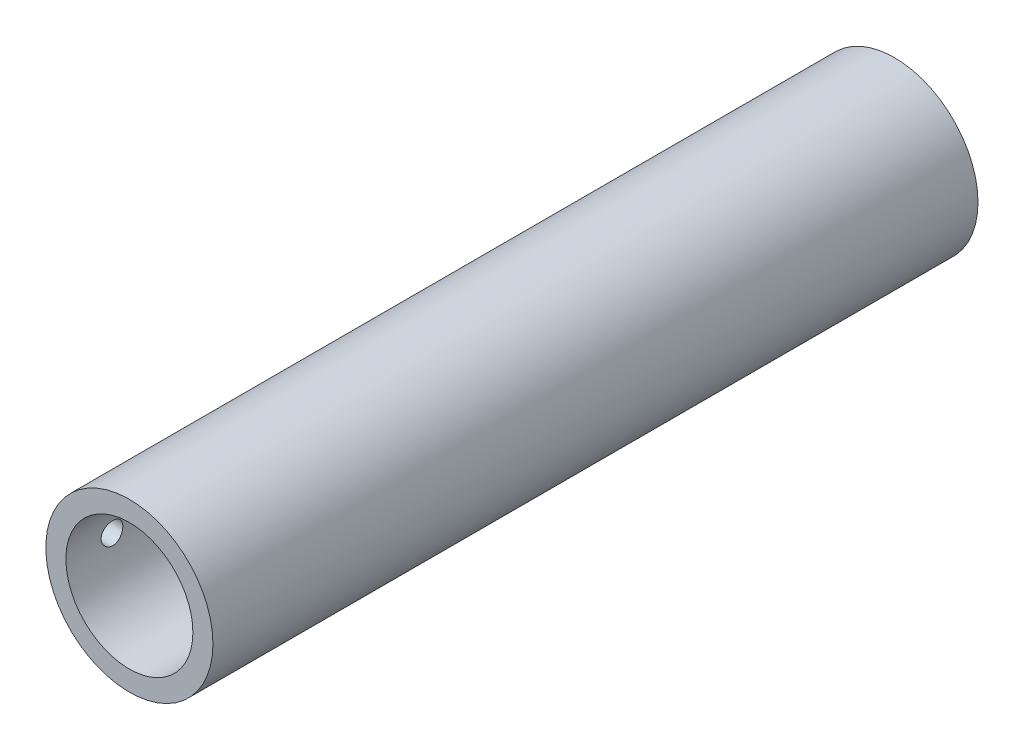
ISO-10303-21;
HEADER;
FILE_DESCRIPTION(('STEP AP214'),'2;1');
FILE_NAME('part.step','',(''),(''),'','','');
FILE_SCHEMA(('AUTOMOTIVE_DESIGN { 1 0 10303 214 1 1 1 1 }'));
ENDSEC;
DATA;
#1=APPLICATION_CONTEXT('core data for automotive mechanical design processes');
#2=APPLICATION_PROTOCOL_DEFINITION('international standard','automotive_design',2000,#1);
#3=PRODUCT_CONTEXT('',#1,'mechanical');
#4=PRODUCT('Part','Part','',(#3));
#5=PRODUCT_RELATED_PRODUCT_CATEGORY('part','',(#4));
#6=PRODUCT_DEFINITION_FORMATION('','',#4);
#7=PRODUCT_DEFINITION_CONTEXT('part definition',#1,'design');
#8=PRODUCT_DEFINITION('design','',#6,#7);
#9=PRODUCT_DEFINITION_SHAPE('','',#8);
#10=(LENGTH_UNIT() NAMED_UNIT(*) SI_UNIT(.MILLI.,.METRE.));
#11=(NAMED_UNIT(*) PLANE_ANGLE_UNIT() SI_UNIT($,.RADIAN.));
#12=(NAMED_UNIT(*) SI_UNIT($,.STERADIAN.) SOLID_ANGLE_UNIT());
#13=UNCERTAINTY_MEASURE_WITH_UNIT(LENGTH_MEASURE(1.E-05),#10,'distance_accuracy_value','');
#14=(GEOMETRIC_REPRESENTATION_CONTEXT(3) GLOBAL_UNCERTAINTY_ASSIGNED_CONTEXT((#13)) GLOBAL_UNIT_ASSIGNED_CONTEXT((#10,
#11,#12)) REPRESENTATION_CONTEXT('',''));
#15=CARTESIAN_POINT('',(0.,0.,0.));
#16=DIRECTION('',(0.,0.,1.));
#17=DIRECTION('',(1.,0.,0.));
#18=AXIS2_PLACEMENT_3D('',#15,#16,#17);
#19=CARTESIAN_POINT('',(0.,0.,116.3));
#20=DIRECTION('',(0.,0.,1.));
#21=DIRECTION('',(1.,0.,0.));
#22=AXIS2_PLACEMENT_3D('',#19,#20,#21);
#23=PLANE('',#22);
#24=CARTESIAN_POINT('',(0.,0.,116.3));
#25=DIRECTION('',(0.,0.,1.));
#26=DIRECTION('',(1.,0.,0.));
#27=AXIS2_PLACEMENT_3D('',#24,#25,#26);
#28=CIRCLE('',#27,12.7);
#29=CARTESIAN_POINT('',(12.7,0.,116.3));
#30=VERTEX_POINT('',#29);
#31=EDGE_CURVE('E10',#30,#30,#28,.T.);
#32=ORIENTED_EDGE('',*,*,#31,.T.);
#33=EDGE_LOOP('',(#32));
#34=FACE_BOUND('',#33,.T.);
#35=CARTESIAN_POINT('',(0.,0.,116.3));
#36=DIRECTION('',(0.,0.,1.));
#37=DIRECTION('',(1.,0.,0.));
#38=AXIS2_PLACEMENT_3D('',#35,#36,#37);
#39=CIRCLE('',#38,9.652);
#40=CARTESIAN_POINT('',(9.652,0.,116.3));
#41=VERTEX_POINT('',#40);
#42=EDGE_CURVE('E50',#41,#41,#39,.T.);
#43=ORIENTED_EDGE('',*,*,#42,.F.);
#44=EDGE_LOOP('',(#43));
#45=FACE_BOUND('',#44,.T.);
#46=ADVANCED_FACE('F32',(#34,#45),#23,.T.);
#47=CARTESIAN_POINT('',(0.,0.,0.));
#48=DIRECTION('',(0.,0.,1.));
#49=DIRECTION('',(1.,0.,0.));
#50=AXIS2_PLACEMENT_3D('',#47,#48,#49);
#51=PLANE('',#50);
#52=CARTESIAN_POINT('',(0.,0.,0.));
#53=DIRECTION('',(0.,0.,1.));
#54=DIRECTION('',(1.,0.,0.));
#55=AXIS2_PLACEMENT_3D('',#52,#53,#54);
#56=CIRCLE('',#55,12.7);
#57=CARTESIAN_POINT('',(12.7,0.,0.));
#58=VERTEX_POINT('',#57);
#59=EDGE_CURVE('E45',#58,#58,#56,.T.);
#60=ORIENTED_EDGE('',*,*,#59,.F.);
#61=EDGE_LOOP('',(#60));
#62=FACE_BOUND('',#61,.T.);
#63=CARTESIAN_POINT('',(0.,0.,0.));
#64=DIRECTION('',(0.,0.,1.));
#65=DIRECTION('',(1.,0.,0.));
#66=AXIS2_PLACEMENT_3D('',#63,#64,#65);
#67=CIRCLE('',#66,9.652);
#68=CARTESIAN_POINT('',(9.652,0.,0.));
#69=VERTEX_POINT('',#68);
#70=EDGE_CURVE('E53',#69,#69,#67,.T.);
#71=ORIENTED_EDGE('',*,*,#70,.T.);
#72=EDGE_LOOP('',(#71));
#73=FACE_BOUND('',#72,.T.);
#74=ADVANCED_FACE('F91',(#62,#73),#51,.F.);
#75=CARTESIAN_POINT('',(0.,0.,116.3));
#76=DIRECTION('',(0.,0.,-1.));
#77=DIRECTION('',(-1.,0.,0.));
#78=AXIS2_PLACEMENT_3D('',#75,#76,#77);
#79=CYLINDRICAL_SURFACE('',#78,12.7);
#80=CARTESIAN_POINT('',(-12.7,0.,19.65));
#81=CARTESIAN_POINT('',(-12.699998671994,-0.0922643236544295,19.6499960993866));
#82=CARTESIAN_POINT('',(-12.698983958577,-0.184585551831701,19.6422350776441));
#83=CARTESIAN_POINT('',(-12.6950336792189,-0.366656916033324,19.6113985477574));
#84=CARTESIAN_POINT('',(-12.6920961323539,-0.456404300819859,19.5883072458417));
#85=CARTESIAN_POINT('',(-12.6846309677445,-0.630665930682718,19.5275037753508));
#86=CARTESIAN_POINT('',(-12.6801044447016,-0.71518373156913,19.4898016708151));
#87=CARTESIAN_POINT('',(-12.6699641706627,-0.876677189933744,19.4008693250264));
#88=CARTESIAN_POINT('',(-12.6643505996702,-0.95365409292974,19.3496413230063));
#89=CARTESIAN_POINT('',(-12.6526253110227,-1.09835248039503,19.2347869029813));
#90=CARTESIAN_POINT('',(-12.6465111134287,-1.16602280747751,19.1710962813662));
#91=CARTESIAN_POINT('',(-12.6344935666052,-1.28974639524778,19.0332624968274));
#92=CARTESIAN_POINT('',(-12.628590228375,-1.34579905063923,18.9591187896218));
#93=CARTESIAN_POINT('',(-12.6176384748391,-1.44488838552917,18.8021488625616));
#94=CARTESIAN_POINT('',(-12.6125932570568,-1.48787683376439,18.7192919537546));
#95=CARTESIAN_POINT('',(-12.6039619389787,-1.5593094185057,18.5474581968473));
#96=CARTESIAN_POINT('',(-12.6003757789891,-1.58775415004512,18.4584815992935));
#97=CARTESIAN_POINT('',(-12.5950924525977,-1.62913573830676,18.2774665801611));
#98=CARTESIAN_POINT('',(-12.5933847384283,-1.64215921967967,18.1854482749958));
#99=CARTESIAN_POINT('',(-12.5920194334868,-1.65259672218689,18.0005175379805));
#100=CARTESIAN_POINT('',(-12.5923617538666,-1.65001141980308,17.9076051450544));
#101=CARTESIAN_POINT('',(-12.595048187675,-1.62937579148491,17.7241288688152));
#102=CARTESIAN_POINT('',(-12.5973799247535,-1.61142107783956,17.6335540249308));
#103=CARTESIAN_POINT('',(-12.6037631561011,-1.5607055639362,17.4567138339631));
#104=CARTESIAN_POINT('',(-12.6078146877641,-1.52794444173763,17.3704485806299));
#105=CARTESIAN_POINT('',(-12.6171949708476,-1.44844392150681,17.2043804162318));
#106=CARTESIAN_POINT('',(-12.6225274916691,-1.40166316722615,17.1245975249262));
#107=CARTESIAN_POINT('',(-12.6338660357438,-1.29548087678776,16.9739782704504));
#108=CARTESIAN_POINT('',(-12.6398720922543,-1.23607871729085,16.9031423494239));
#109=CARTESIAN_POINT('',(-12.6519359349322,-1.10581086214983,16.7718729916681));
#110=CARTESIAN_POINT('',(-12.6579937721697,-1.03486279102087,16.7115212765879));
#111=CARTESIAN_POINT('',(-12.6694366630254,-0.88380016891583,16.6035704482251));
#112=CARTESIAN_POINT('',(-12.6748217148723,-0.803685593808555,16.5559713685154));
#113=CARTESIAN_POINT('',(-12.6843160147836,-0.63649967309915,16.4748761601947));
#114=CARTESIAN_POINT('',(-12.6884247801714,-0.549425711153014,16.4413853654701));
#115=CARTESIAN_POINT('',(-12.6948992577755,-0.370824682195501,16.3895234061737));
#116=CARTESIAN_POINT('',(-12.697265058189,-0.279297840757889,16.371151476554));
#117=CARTESIAN_POINT('',(-12.6999755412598,-0.0950955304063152,16.3501551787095));
#118=CARTESIAN_POINT('',(-12.7003346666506,-0.00243309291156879,16.3474182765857));
#119=CARTESIAN_POINT('',(-12.6990303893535,0.182029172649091,16.357472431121));
#120=CARTESIAN_POINT('',(-12.6973670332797,0.273829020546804,16.3702631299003));
#121=CARTESIAN_POINT('',(-12.6922136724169,0.453626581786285,16.4109158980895));
#122=CARTESIAN_POINT('',(-12.6887301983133,0.541636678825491,16.4387240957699));
#123=CARTESIAN_POINT('',(-12.6803264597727,0.711744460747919,16.508566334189));
#124=CARTESIAN_POINT('',(-12.6754061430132,0.793841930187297,16.5506008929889));
#125=CARTESIAN_POINT('',(-12.6646409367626,0.950295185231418,16.6479734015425));
#126=CARTESIAN_POINT('',(-12.6587910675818,1.02460547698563,16.7033838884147));
#127=CARTESIAN_POINT('',(-12.6468361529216,1.1629116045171,16.8258330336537));
#128=CARTESIAN_POINT('',(-12.6407310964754,1.22690699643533,16.8928721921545));
#129=CARTESIAN_POINT('',(-12.6289090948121,1.34316787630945,17.0371723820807));
#130=CARTESIAN_POINT('',(-12.6231947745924,1.39535861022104,17.114493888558));
#131=CARTESIAN_POINT('',(-12.6128450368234,1.48601166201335,17.2768714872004));
#132=CARTESIAN_POINT('',(-12.608209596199,1.52447427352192,17.3619274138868));
#133=CARTESIAN_POINT('',(-12.6005605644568,1.58645918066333,17.537121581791));
#134=CARTESIAN_POINT('',(-12.5975424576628,1.61002310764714,17.6272448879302));
#135=CARTESIAN_POINT('',(-12.5934570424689,1.64167555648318,17.810211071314));
#136=CARTESIAN_POINT('',(-12.5923896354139,1.6497648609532,17.9030538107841));
#137=CARTESIAN_POINT('',(-12.5923295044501,1.65022329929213,18.0880794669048));
#138=CARTESIAN_POINT('',(-12.5933212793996,1.64270988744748,18.180262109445));
#139=CARTESIAN_POINT('',(-12.5972343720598,1.61242543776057,18.3620422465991));
#140=CARTESIAN_POINT('',(-12.6001556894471,1.58965440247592,18.4516397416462));
#141=CARTESIAN_POINT('',(-12.6075937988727,1.52953872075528,18.6256876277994));
#142=CARTESIAN_POINT('',(-12.6121099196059,1.49220020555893,18.7101401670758));
#143=CARTESIAN_POINT('',(-12.6222298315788,1.40402101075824,18.8716002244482));
#144=CARTESIAN_POINT('',(-12.6278336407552,1.35318010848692,18.9486076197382));
#145=CARTESIAN_POINT('',(-12.6395480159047,1.23900511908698,19.0935912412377));
#146=CARTESIAN_POINT('',(-12.6456619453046,1.17558357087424,19.1614983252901));
#147=CARTESIAN_POINT('',(-12.6576782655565,1.03823082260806,19.2857502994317));
#148=CARTESIAN_POINT('',(-12.6635806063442,0.964297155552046,19.3420924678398));
#149=CARTESIAN_POINT('',(-12.6745356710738,0.807668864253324,19.4418142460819));
#150=CARTESIAN_POINT('',(-12.6795848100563,0.724939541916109,19.4851397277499));
#151=CARTESIAN_POINT('',(-12.6882285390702,0.553358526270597,19.5572202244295));
#152=CARTESIAN_POINT('',(-12.6918246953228,0.464513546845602,19.5859909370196));
#153=CARTESIAN_POINT('',(-12.6962987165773,0.312682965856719,19.6213236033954));
#154=CARTESIAN_POINT('',(-12.6976798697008,0.250651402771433,19.6320616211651));
#155=CARTESIAN_POINT('',(-12.6995309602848,0.125755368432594,19.6464011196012));
#156=CARTESIAN_POINT('',(-12.7000009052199,0.0628909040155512,19.6500026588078));
#157=CARTESIAN_POINT('',(-12.7,0.,19.65));
#158=B_SPLINE_CURVE_WITH_KNOTS('',3,(#80,#81,#82,#83,#84,#85,#86,#87,#88,#89,#90,#91,#92,#93,
#94,#95,#96,#97,#98,#99,#100,#101,#102,#103,#104,#105,#106,#107,#108,#109,#110,#111,#112,#113,
#114,#115,#116,#117,#118,#119,#120,#121,#122,#123,#124,#125,#126,#127,#128,#129,#130,#131,#132,
#133,#134,#135,#136,#137,#138,#139,#140,#141,#142,#143,#144,#145,#146,#147,#148,#149,#150,#151,
#152,#153,#154,#155,#156,#157),.UNSPECIFIED.,.T.,.F.,(4,2,2,2,2,2,2,2,2,2,2,2,2,2,2,2,2,2,2,2,2,
2,2,2,2,2,2,2,2,2,2,2,2,2,2,2,2,2,4),(0.,0.276563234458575,0.553411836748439,0.830070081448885,
1.10668255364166,1.38475946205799,1.66285085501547,1.94195678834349,2.22105130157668,
2.49857052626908,2.77607772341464,3.05187100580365,3.327670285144,3.60429128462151,
3.88092594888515,4.15962857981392,4.43833194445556,4.71714058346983,4.99593511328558,
5.27272045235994,5.54949941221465,5.82529202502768,6.10109468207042,6.37842800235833,
6.65577325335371,6.93482849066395,7.21387775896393,7.49214379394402,7.77039575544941,
8.04656068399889,8.32272556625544,8.59877433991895,8.8748276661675,9.1528719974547,
9.43098168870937,9.71023234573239,9.98918118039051,10.1776988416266,10.3662149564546),.UNSPECIFIED.);
#159=CARTESIAN_POINT('',(-12.7,0.,19.65));
#160=VERTEX_POINT('',#159);
#161=EDGE_CURVE('E150',#160,#160,#158,.T.);
#162=ORIENTED_EDGE('',*,*,#161,.T.);
#163=EDGE_LOOP('',(#162));
#164=FACE_BOUND('',#163,.T.);
#165=CARTESIAN_POINT('',(-12.7,0.,31.45));
#166=CARTESIAN_POINT('',(-12.699998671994,-0.0922643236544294,31.4499960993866));
#167=CARTESIAN_POINT('',(-12.698983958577,-0.184585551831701,31.4422350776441));
#168=CARTESIAN_POINT('',(-12.6950336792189,-0.366656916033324,31.4113985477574));
#169=CARTESIAN_POINT('',(-12.6920961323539,-0.456404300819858,31.3883072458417));
#170=CARTESIAN_POINT('',(-12.6846309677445,-0.630665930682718,31.3275037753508));
#171=CARTESIAN_POINT('',(-12.6801044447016,-0.71518373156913,31.2898016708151));
#172=CARTESIAN_POINT('',(-12.6699641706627,-0.876677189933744,31.2008693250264));
#173=CARTESIAN_POINT('',(-12.6643505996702,-0.95365409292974,31.1496413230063));
#174=CARTESIAN_POINT('',(-12.6526253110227,-1.09835248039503,31.0347869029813));
#175=CARTESIAN_POINT('',(-12.6465111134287,-1.16602280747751,30.9710962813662));
#176=CARTESIAN_POINT('',(-12.6344935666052,-1.28974639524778,30.8332624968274));
#177=CARTESIAN_POINT('',(-12.628590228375,-1.34579905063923,30.7591187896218));
#178=CARTESIAN_POINT('',(-12.6176384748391,-1.44488838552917,30.6021488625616));
#179=CARTESIAN_POINT('',(-12.6125932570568,-1.48787683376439,30.5192919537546));
#180=CARTESIAN_POINT('',(-12.6039619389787,-1.5593094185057,30.3474581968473));
#181=CARTESIAN_POINT('',(-12.6003757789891,-1.58775415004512,30.2584815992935));
#182=CARTESIAN_POINT('',(-12.5950924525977,-1.62913573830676,30.0774665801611));
#183=CARTESIAN_POINT('',(-12.5933847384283,-1.64215921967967,29.9854482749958));
#184=CARTESIAN_POINT('',(-12.5920194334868,-1.65259672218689,29.8005175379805));
#185=CARTESIAN_POINT('',(-12.5923617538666,-1.65001141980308,29.7076051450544));
#186=CARTESIAN_POINT('',(-12.595048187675,-1.62937579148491,29.5241288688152));
#187=CARTESIAN_POINT('',(-12.5973799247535,-1.61142107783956,29.4335540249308));
#188=CARTESIAN_POINT('',(-12.6037631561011,-1.5607055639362,29.2567138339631));
#189=CARTESIAN_POINT('',(-12.6078146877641,-1.52794444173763,29.1704485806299));
#190=CARTESIAN_POINT('',(-12.6171949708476,-1.44844392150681,29.0043804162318));
#191=CARTESIAN_POINT('',(-12.6225274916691,-1.40166316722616,28.9245975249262));
#192=CARTESIAN_POINT('',(-12.6338660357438,-1.29548087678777,28.7739782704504));
#193=CARTESIAN_POINT('',(-12.6398720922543,-1.23607871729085,28.7031423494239));
#194=CARTESIAN_POINT('',(-12.6519359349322,-1.10581086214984,28.5718729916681));
#195=CARTESIAN_POINT('',(-12.6579937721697,-1.03486279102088,28.5115212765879));
#196=CARTESIAN_POINT('',(-12.6694366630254,-0.883800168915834,28.403570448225));
#197=CARTESIAN_POINT('',(-12.6748217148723,-0.803685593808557,28.3559713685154));
#198=CARTESIAN_POINT('',(-12.6843160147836,-0.63649967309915,28.2748761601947));
#199=CARTESIAN_POINT('',(-12.6884247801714,-0.549425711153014,28.2413853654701));
#200=CARTESIAN_POINT('',(-12.6948992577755,-0.370824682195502,28.1895234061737));
#201=CARTESIAN_POINT('',(-12.697265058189,-0.27929784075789,28.171151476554));
#202=CARTESIAN_POINT('',(-12.6999755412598,-0.0950955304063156,28.1501551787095));
#203=CARTESIAN_POINT('',(-12.7003346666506,-0.00243309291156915,28.1474182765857));
#204=CARTESIAN_POINT('',(-12.6990303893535,0.182029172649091,28.157472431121));
#205=CARTESIAN_POINT('',(-12.6973670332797,0.273829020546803,28.1702631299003));
#206=CARTESIAN_POINT('',(-12.6922136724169,0.453626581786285,28.2109158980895));
#207=CARTESIAN_POINT('',(-12.6887301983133,0.541636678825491,28.2387240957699));
#208=CARTESIAN_POINT('',(-12.6803264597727,0.711744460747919,28.308566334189));
#209=CARTESIAN_POINT('',(-12.6754061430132,0.793841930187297,28.3506008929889));
#210=CARTESIAN_POINT('',(-12.6646409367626,0.950295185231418,28.4479734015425));
#211=CARTESIAN_POINT('',(-12.6587910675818,1.02460547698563,28.5033838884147));
#212=CARTESIAN_POINT('',(-12.6468361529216,1.1629116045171,28.6258330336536));
#213=CARTESIAN_POINT('',(-12.6407310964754,1.22690699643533,28.6928721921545));
#214=CARTESIAN_POINT('',(-12.6289090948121,1.34316787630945,28.8371723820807));
#215=CARTESIAN_POINT('',(-12.6231947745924,1.39535861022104,28.9144938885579));
#216=CARTESIAN_POINT('',(-12.6128450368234,1.48601166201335,29.0768714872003));
#217=CARTESIAN_POINT('',(-12.608209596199,1.52447427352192,29.1619274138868));
#218=CARTESIAN_POINT('',(-12.6005605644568,1.58645918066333,29.337121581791));
#219=CARTESIAN_POINT('',(-12.5975424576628,1.61002310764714,29.4272448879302));
#220=CARTESIAN_POINT('',(-12.5934570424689,1.64167555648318,29.6102110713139));
#221=CARTESIAN_POINT('',(-12.5923896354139,1.6497648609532,29.7030538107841));
#222=CARTESIAN_POINT('',(-12.5923295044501,1.65022329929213,29.8880794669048));
#223=CARTESIAN_POINT('',(-12.5933212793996,1.64270988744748,29.980262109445));
#224=CARTESIAN_POINT('',(-12.5972343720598,1.61242543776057,30.1620422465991));
#225=CARTESIAN_POINT('',(-12.6001556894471,1.58965440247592,30.2516397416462));
#226=CARTESIAN_POINT('',(-12.6075937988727,1.52953872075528,30.4256876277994));
#227=CARTESIAN_POINT('',(-12.6121099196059,1.49220020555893,30.5101401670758));
#228=CARTESIAN_POINT('',(-12.6222298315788,1.40402101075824,30.6716002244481));
#229=CARTESIAN_POINT('',(-12.6278336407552,1.35318010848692,30.7486076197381));
#230=CARTESIAN_POINT('',(-12.6395480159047,1.23900511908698,30.8935912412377));
#231=CARTESIAN_POINT('',(-12.6456619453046,1.17558357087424,30.9614983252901));
#232=CARTESIAN_POINT('',(-12.6576782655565,1.03823082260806,31.0857502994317));
#233=CARTESIAN_POINT('',(-12.6635806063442,0.964297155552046,31.1420924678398));
#234=CARTESIAN_POINT('',(-12.6745356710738,0.807668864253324,31.2418142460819));
#235=CARTESIAN_POINT('',(-12.6795848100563,0.72493954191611,31.2851397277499));
#236=CARTESIAN_POINT('',(-12.6882285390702,0.553358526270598,31.3572202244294));
#237=CARTESIAN_POINT('',(-12.6918246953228,0.464513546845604,31.3859909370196));
#238=CARTESIAN_POINT('',(-12.6962987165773,0.312682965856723,31.4213236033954));
#239=CARTESIAN_POINT('',(-12.6976798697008,0.250651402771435,31.4320616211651));
#240=CARTESIAN_POINT('',(-12.6995309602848,0.125755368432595,31.4464011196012));
#241=CARTESIAN_POINT('',(-12.7000009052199,0.062890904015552,31.4500026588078));
#242=CARTESIAN_POINT('',(-12.7,0.,31.45));
#243=B_SPLINE_CURVE_WITH_KNOTS('',3,(#165,#166,#167,#168,#169,#170,#171,#172,#173,#174,#175,
#176,#177,#178,#179,#180,#181,#182,#183,#184,#185,#186,#187,#188,#189,#190,#191,#192,#193,#194,
#195,#196,#197,#198,#199,#200,#201,#202,#203,#204,#205,#206,#207,#208,#209,#210,#211,#212,#213,
#214,#215,#216,#217,#218,#219,#220,#221,#222,#223,#224,#225,#226,#227,#228,#229,#230,#231,#232,
#233,#234,#235,#236,#237,#238,#239,#240,#241,#242),.UNSPECIFIED.,.T.,.F.,(4,2,2,2,2,2,2,2,2,2,2,
2,2,2,2,2,2,2,2,2,2,2,2,2,2,2,2,2,2,2,2,2,2,2,2,2,2,2,4),(0.,0.276563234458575,
0.553411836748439,0.830070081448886,1.10668255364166,1.38475946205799,1.66285085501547,
1.94195678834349,2.22105130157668,2.49857052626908,2.77607772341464,3.05187100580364,
3.327670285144,3.6042912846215,3.88092594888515,4.15962857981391,4.43833194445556,
4.71714058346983,4.99593511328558,5.27272045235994,5.54949941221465,5.82529202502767,
6.10109468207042,6.37842800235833,6.65577325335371,6.93482849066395,7.21387775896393,
7.49214379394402,7.7703957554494,8.04656068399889,8.32272556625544,8.59877433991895,
8.8748276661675,9.1528719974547,9.43098168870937,9.71023234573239,9.9891811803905,
10.1776988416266,10.3662149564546),.UNSPECIFIED.);
#244=CARTESIAN_POINT('',(-12.7,0.,31.45));
#245=VERTEX_POINT('',#244);
#246=EDGE_CURVE('E62',#245,#245,#243,.T.);
#247=ORIENTED_EDGE('',*,*,#246,.T.);
#248=EDGE_LOOP('',(#247));
#249=FACE_BOUND('',#248,.T.);
#250=CARTESIAN_POINT('',(-12.7,0.,110.95));
#251=CARTESIAN_POINT('',(-12.699998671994,-0.0922643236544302,110.949996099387));
#252=CARTESIAN_POINT('',(-12.698983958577,-0.184585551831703,110.942235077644));
#253=CARTESIAN_POINT('',(-12.6950336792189,-0.366656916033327,110.911398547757));
#254=CARTESIAN_POINT('',(-12.6920961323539,-0.456404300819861,110.888307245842));
#255=CARTESIAN_POINT('',(-12.6846309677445,-0.630665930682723,110.827503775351));
#256=CARTESIAN_POINT('',(-12.6801044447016,-0.715183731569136,110.789801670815));
#257=CARTESIAN_POINT('',(-12.6699641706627,-0.876677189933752,110.700869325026));
#258=CARTESIAN_POINT('',(-12.6643505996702,-0.953654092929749,110.649641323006));
#259=CARTESIAN_POINT('',(-12.6526253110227,-1.09835248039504,110.534786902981));
#260=CARTESIAN_POINT('',(-12.6465111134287,-1.16602280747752,110.471096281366));
#261=CARTESIAN_POINT('',(-12.6344935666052,-1.28974639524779,110.333262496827));
#262=CARTESIAN_POINT('',(-12.628590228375,-1.34579905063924,110.259118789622));
#263=CARTESIAN_POINT('',(-12.6176384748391,-1.44488838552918,110.102148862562));
#264=CARTESIAN_POINT('',(-12.6125932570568,-1.4878768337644,110.019291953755));
#265=CARTESIAN_POINT('',(-12.6039619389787,-1.55930941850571,109.847458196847));
#266=CARTESIAN_POINT('',(-12.6003757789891,-1.58775415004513,109.758481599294));
#267=CARTESIAN_POINT('',(-12.5950924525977,-1.62913573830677,109.577466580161));
#268=CARTESIAN_POINT('',(-12.5933847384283,-1.64215921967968,109.485448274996));
#269=CARTESIAN_POINT('',(-12.5920194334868,-1.65259672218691,109.300517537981));
#270=CARTESIAN_POINT('',(-12.5923617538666,-1.6500114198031,109.207605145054));
#271=CARTESIAN_POINT('',(-12.5950481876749,-1.62937579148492,109.024128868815));
#272=CARTESIAN_POINT('',(-12.5973799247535,-1.61142107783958,108.933554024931));
#273=CARTESIAN_POINT('',(-12.6037631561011,-1.56070556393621,108.756713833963));
#274=CARTESIAN_POINT('',(-12.6078146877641,-1.52794444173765,108.67044858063));
#275=CARTESIAN_POINT('',(-12.6171949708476,-1.44844392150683,108.504380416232));
#276=CARTESIAN_POINT('',(-12.6225274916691,-1.40166316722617,108.424597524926));
#277=CARTESIAN_POINT('',(-12.6338660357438,-1.29548087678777,108.27397827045));
#278=CARTESIAN_POINT('',(-12.6398720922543,-1.23607871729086,108.203142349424));
#279=CARTESIAN_POINT('',(-12.6519359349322,-1.10581086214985,108.071872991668));
#280=CARTESIAN_POINT('',(-12.6579937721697,-1.03486279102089,108.011521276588));
#281=CARTESIAN_POINT('',(-12.6694366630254,-0.883800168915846,107.903570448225));
#282=CARTESIAN_POINT('',(-12.6748217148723,-0.803685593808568,107.855971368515));
#283=CARTESIAN_POINT('',(-12.6843160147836,-0.636499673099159,107.774876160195));
#284=CARTESIAN_POINT('',(-12.6884247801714,-0.549425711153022,107.74138536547));
#285=CARTESIAN_POINT('',(-12.6948992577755,-0.370824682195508,107.689523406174));
#286=CARTESIAN_POINT('',(-12.697265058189,-0.279297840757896,107.671151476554));
#287=CARTESIAN_POINT('',(-12.6999755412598,-0.0950955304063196,107.650155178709));
#288=CARTESIAN_POINT('',(-12.7003346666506,-0.00243309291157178,107.647418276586));
#289=CARTESIAN_POINT('',(-12.6990303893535,0.18202917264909,107.657472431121));
#290=CARTESIAN_POINT('',(-12.6973670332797,0.273829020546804,107.6702631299));
#291=CARTESIAN_POINT('',(-12.6922136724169,0.453626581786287,107.71091589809));
#292=CARTESIAN_POINT('',(-12.6887301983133,0.541636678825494,107.73872409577));
#293=CARTESIAN_POINT('',(-12.6803264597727,0.711744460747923,107.808566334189));
#294=CARTESIAN_POINT('',(-12.6754061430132,0.793841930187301,107.850600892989));
#295=CARTESIAN_POINT('',(-12.6646409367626,0.950295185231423,107.947973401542));
#296=CARTESIAN_POINT('',(-12.6587910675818,1.02460547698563,108.003383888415));
#297=CARTESIAN_POINT('',(-12.6468361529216,1.1629116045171,108.125833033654));
#298=CARTESIAN_POINT('',(-12.6407310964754,1.22690699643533,108.192872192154));
#299=CARTESIAN_POINT('',(-12.6289090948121,1.34316787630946,108.337172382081));
#300=CARTESIAN_POINT('',(-12.6231947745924,1.39535861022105,108.414493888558));
#301=CARTESIAN_POINT('',(-12.6128450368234,1.48601166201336,108.5768714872));
#302=CARTESIAN_POINT('',(-12.608209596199,1.52447427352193,108.661927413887));
#303=CARTESIAN_POINT('',(-12.6005605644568,1.58645918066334,108.837121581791));
#304=CARTESIAN_POINT('',(-12.5975424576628,1.61002310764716,108.92724488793));
#305=CARTESIAN_POINT('',(-12.5934570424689,1.6416755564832,109.110211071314));
#306=CARTESIAN_POINT('',(-12.5923896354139,1.64976486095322,109.203053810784));
#307=CARTESIAN_POINT('',(-12.5923295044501,1.65022329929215,109.388079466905));
#308=CARTESIAN_POINT('',(-12.5933212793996,1.64270988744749,109.480262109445));
#309=CARTESIAN_POINT('',(-12.5972343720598,1.61242543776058,109.662042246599));
#310=CARTESIAN_POINT('',(-12.6001556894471,1.58965440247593,109.751639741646));
#311=CARTESIAN_POINT('',(-12.6075937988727,1.52953872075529,109.925687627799));
#312=CARTESIAN_POINT('',(-12.6121099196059,1.49220020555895,110.010140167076));
#313=CARTESIAN_POINT('',(-12.6222298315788,1.40402101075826,110.171600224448));
#314=CARTESIAN_POINT('',(-12.6278336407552,1.35318010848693,110.248607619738));
#315=CARTESIAN_POINT('',(-12.6395480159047,1.23900511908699,110.393591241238));
#316=CARTESIAN_POINT('',(-12.6456619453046,1.17558357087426,110.46149832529));
#317=CARTESIAN_POINT('',(-12.6576782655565,1.03823082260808,110.585750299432));
#318=CARTESIAN_POINT('',(-12.6635806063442,0.964297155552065,110.64209246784));
#319=CARTESIAN_POINT('',(-12.6745356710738,0.807668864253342,110.741814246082));
#320=CARTESIAN_POINT('',(-12.6795848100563,0.724939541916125,110.78513972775));
#321=CARTESIAN_POINT('',(-12.6882285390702,0.553358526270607,110.857220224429));
#322=CARTESIAN_POINT('',(-12.6918246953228,0.464513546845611,110.88599093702));
#323=CARTESIAN_POINT('',(-12.6962987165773,0.312682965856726,110.921323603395));
#324=CARTESIAN_POINT('',(-12.6976798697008,0.250651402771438,110.932061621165));
#325=CARTESIAN_POINT('',(-12.6995309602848,0.125755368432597,110.946401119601));
#326=CARTESIAN_POINT('',(-12.7000009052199,0.0628909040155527,110.950002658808));
#327=CARTESIAN_POINT('',(-12.7,0.,110.95));
#328=B_SPLINE_CURVE_WITH_KNOTS('',3,(#250,#251,#252,#253,#254,#255,#256,#257,#258,#259,#260,
#261,#262,#263,#264,#265,#266,#267,#268,#269,#270,#271,#272,#273,#274,#275,#276,#277,#278,#279,
#280,#281,#282,#283,#284,#285,#286,#287,#288,#289,#290,#291,#292,#293,#294,#295,#296,#297,#298,
#299,#300,#301,#302,#303,#304,#305,#306,#307,#308,#309,#310,#311,#312,#313,#314,#315,#316,#317,
#318,#319,#320,#321,#322,#323,#324,#325,#326,#327),.UNSPECIFIED.,.T.,.F.,(4,2,2,2,2,2,2,2,2,2,2,
2,2,2,2,2,2,2,2,2,2,2,2,2,2,2,2,2,2,2,2,2,2,2,2,2,2,2,4),(0.,0.276563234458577,
0.553411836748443,0.830070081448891,1.10668255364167,1.384759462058,1.66285085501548,
1.9419567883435,2.22105130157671,2.4985705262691,2.77607772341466,3.05187100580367,
3.32767028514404,3.60429128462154,3.88092594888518,4.15962857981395,4.4383319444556,
4.71714058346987,4.99593511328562,5.27272045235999,5.5494994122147,5.82529202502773,
6.10109468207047,6.37842800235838,6.65577325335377,6.934828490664,7.21387775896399,
7.4921437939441,7.77039575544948,8.04656068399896,8.32272556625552,8.59877433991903,
8.87482766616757,9.15287199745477,9.43098168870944,9.71023234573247,9.9891811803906,
10.1776988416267,10.3662149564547),.UNSPECIFIED.);
#329=CARTESIAN_POINT('',(-12.7,0.,110.95));
#330=VERTEX_POINT('',#329);
#331=EDGE_CURVE('E61',#330,#330,#328,.T.);
#332=ORIENTED_EDGE('',*,*,#331,.T.);
#333=EDGE_LOOP('',(#332));
#334=FACE_BOUND('',#333,.T.);
#335=ORIENTED_EDGE('',*,*,#31,.F.);
#336=EDGE_LOOP('',(#335));
#337=FACE_BOUND('',#336,.T.);
#338=ORIENTED_EDGE('',*,*,#59,.T.);
#339=EDGE_LOOP('',(#338));
#340=FACE_BOUND('',#339,.T.);
#341=ADVANCED_FACE('F34',(#164,#249,#334,#337,#340),#79,.T.);
#342=CARTESIAN_POINT('',(0.,0.,116.3));
#343=DIRECTION('',(0.,0.,-1.));
#344=DIRECTION('',(-1.,0.,0.));
#345=AXIS2_PLACEMENT_3D('',#342,#343,#344);
#346=CYLINDRICAL_SURFACE('',#345,9.652);
#347=CARTESIAN_POINT('',(-9.652,0.,19.65));
#348=CARTESIAN_POINT('',(-9.65199840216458,-0.0919628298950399,19.6499963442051));
#349=CARTESIAN_POINT('',(-9.65067202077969,-0.183974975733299,19.642285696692));
#350=CARTESIAN_POINT('',(-9.64550856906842,-0.365416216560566,19.6116610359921));
#351=CARTESIAN_POINT('',(-9.64166922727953,-0.454842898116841,19.5887332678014));
#352=CARTESIAN_POINT('',(-9.63191026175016,-0.628462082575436,19.5283888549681));
#353=CARTESIAN_POINT('',(-9.62599237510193,-0.712658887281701,19.4909843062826));
#354=CARTESIAN_POINT('',(-9.61272612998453,-0.873571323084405,19.4027803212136));
#355=CARTESIAN_POINT('',(-9.6053779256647,-0.950287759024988,19.35198232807));
#356=CARTESIAN_POINT('',(-9.58998249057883,-1.09484183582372,19.2378913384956));
#357=CARTESIAN_POINT('',(-9.58192957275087,-1.1625935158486,19.174490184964));
#358=CARTESIAN_POINT('',(-9.56607559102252,-1.28655210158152,19.0372253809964));
#359=CARTESIAN_POINT('',(-9.55827454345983,-1.34275825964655,18.9633610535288));
#360=CARTESIAN_POINT('',(-9.54375245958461,-1.44237739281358,18.8066727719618));
#361=CARTESIAN_POINT('',(-9.53703876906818,-1.48570488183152,18.7237937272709));
#362=CARTESIAN_POINT('',(-9.52553070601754,-1.55778998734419,18.5517998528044));
#363=CARTESIAN_POINT('',(-9.52073619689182,-1.5865486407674,18.4626854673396));
#364=CARTESIAN_POINT('',(-9.51366609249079,-1.62840788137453,18.2816634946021));
#365=CARTESIAN_POINT('',(-9.51136658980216,-1.64165717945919,18.1897912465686));
#366=CARTESIAN_POINT('',(-9.50947458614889,-1.65258279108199,18.0051010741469));
#367=CARTESIAN_POINT('',(-9.5098818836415,-1.65026026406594,17.9122832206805));
#368=CARTESIAN_POINT('',(-9.51333564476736,-1.63022917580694,17.7294012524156));
#369=CARTESIAN_POINT('',(-9.51635338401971,-1.61268806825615,17.6393181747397));
#370=CARTESIAN_POINT('',(-9.5246430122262,-1.5629807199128,17.4633927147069));
#371=CARTESIAN_POINT('',(-9.52991498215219,-1.53081395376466,17.3775504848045));
#372=CARTESIAN_POINT('',(-9.54214988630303,-1.45259979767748,17.2120443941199));
#373=CARTESIAN_POINT('',(-9.54912121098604,-1.40648325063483,17.132413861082));
#374=CARTESIAN_POINT('',(-9.56396356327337,-1.30172767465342,16.9819579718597));
#375=CARTESIAN_POINT('',(-9.57183466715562,-1.2430875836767,16.9111333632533));
#376=CARTESIAN_POINT('',(-9.58771571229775,-1.11403899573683,16.7793308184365));
#377=CARTESIAN_POINT('',(-9.59572612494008,-1.04348691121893,16.7184934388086));
#378=CARTESIAN_POINT('',(-9.61088837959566,-0.893101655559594,16.6094989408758));
#379=CARTESIAN_POINT('',(-9.61804021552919,-0.813268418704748,16.5613419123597));
#380=CARTESIAN_POINT('',(-9.63069044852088,-0.646452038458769,16.4790607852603));
#381=CARTESIAN_POINT('',(-9.63618733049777,-0.559462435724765,16.4449495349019));
#382=CARTESIAN_POINT('',(-9.64489624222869,-0.380873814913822,16.3918609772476));
#383=CARTESIAN_POINT('',(-9.64810847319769,-0.289275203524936,16.3728823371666));
#384=CARTESIAN_POINT('',(-9.65185898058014,-0.105279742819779,16.3507892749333));
#385=CARTESIAN_POINT('',(-9.65242976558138,-0.012906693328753,16.3474819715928));
#386=CARTESIAN_POINT('',(-9.65092225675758,0.171073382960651,16.3563106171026));
#387=CARTESIAN_POINT('',(-9.64884407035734,0.262680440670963,16.368445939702));
#388=CARTESIAN_POINT('',(-9.64229227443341,0.441929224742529,16.4076549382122));
#389=CARTESIAN_POINT('',(-9.63783404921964,0.529592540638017,16.4346327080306));
#390=CARTESIAN_POINT('',(-9.62702002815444,0.699152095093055,16.5026582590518));
#391=CARTESIAN_POINT('',(-9.62066412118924,0.781047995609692,16.5437068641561));
#392=CARTESIAN_POINT('',(-9.60667902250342,0.937582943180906,16.6391476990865));
#393=CARTESIAN_POINT('',(-9.59903859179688,1.01214781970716,16.6936598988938));
#394=CARTESIAN_POINT('',(-9.58336480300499,1.15114041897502,16.8143160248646));
#395=CARTESIAN_POINT('',(-9.57533141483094,1.21556736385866,16.8804608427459));
#396=CARTESIAN_POINT('',(-9.55967146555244,1.33317377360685,17.0233713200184));
#397=CARTESIAN_POINT('',(-9.5520503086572,1.38622265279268,17.1002451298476));
#398=CARTESIAN_POINT('',(-9.53818013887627,1.47865386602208,17.2619262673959));
#399=CARTESIAN_POINT('',(-9.53193108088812,1.51803664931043,17.3467333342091));
#400=CARTESIAN_POINT('',(-9.52155357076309,1.58182440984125,17.5215151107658));
#401=CARTESIAN_POINT('',(-9.51741607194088,1.60629337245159,17.6114659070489));
#402=CARTESIAN_POINT('',(-9.51170783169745,1.63975953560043,17.7942778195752));
#403=CARTESIAN_POINT('',(-9.51013685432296,1.64875815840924,17.8871386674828));
#404=CARTESIAN_POINT('',(-9.50975005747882,1.65098696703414,18.0718299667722));
#405=CARTESIAN_POINT('',(-9.51089830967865,1.64442277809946,18.1636579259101));
#406=CARTESIAN_POINT('',(-9.51574166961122,1.61615801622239,18.3448820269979));
#407=CARTESIAN_POINT('',(-9.5194367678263,1.59445749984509,18.4342781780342));
#408=CARTESIAN_POINT('',(-9.52894352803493,1.53661645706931,18.6080153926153));
#409=CARTESIAN_POINT('',(-9.53475246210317,1.50049453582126,18.6923628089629));
#410=CARTESIAN_POINT('',(-9.54783486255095,1.41485741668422,18.8538334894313));
#411=CARTESIAN_POINT('',(-9.55510840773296,1.36534149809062,18.930956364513));
#412=CARTESIAN_POINT('',(-9.57041392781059,1.2535918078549,19.0768259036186));
#413=CARTESIAN_POINT('',(-9.57845423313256,1.1912070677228,19.145456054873));
#414=CARTESIAN_POINT('',(-9.5943217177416,1.05580836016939,19.271343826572));
#415=CARTESIAN_POINT('',(-9.6021488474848,0.982791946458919,19.3285988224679));
#416=CARTESIAN_POINT('',(-9.61677451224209,0.827567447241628,19.4304951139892));
#417=CARTESIAN_POINT('',(-9.62356511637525,0.745296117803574,19.4750412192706));
#418=CARTESIAN_POINT('',(-9.63527544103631,0.574354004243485,19.5496114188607));
#419=CARTESIAN_POINT('',(-9.64019700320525,0.48568962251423,19.5796498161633));
#420=CARTESIAN_POINT('',(-9.64655446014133,0.330580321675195,19.6179139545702));
#421=CARTESIAN_POINT('',(-9.6485855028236,0.265067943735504,19.6299267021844));
#422=CARTESIAN_POINT('',(-9.65130883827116,0.133045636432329,19.6459709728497));
#423=CARTESIAN_POINT('',(-9.65200115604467,0.0665357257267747,19.6500026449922));
#424=CARTESIAN_POINT('',(-9.652,0.,19.65));
#425=B_SPLINE_CURVE_WITH_KNOTS('',3,(#347,#348,#349,#350,#351,#352,#353,#354,#355,#356,#357,
#358,#359,#360,#361,#362,#363,#364,#365,#366,#367,#368,#369,#370,#371,#372,#373,#374,#375,#376,
#377,#378,#379,#380,#381,#382,#383,#384,#385,#386,#387,#388,#389,#390,#391,#392,#393,#394,#395,
#396,#397,#398,#399,#400,#401,#402,#403,#404,#405,#406,#407,#408,#409,#410,#411,#412,#413,#414,
#415,#416,#417,#418,#419,#420,#421,#422,#423,#424),.UNSPECIFIED.,.T.,.F.,(4,2,2,2,2,2,2,2,2,2,2,
2,2,2,2,2,2,2,2,2,2,2,2,2,2,2,2,2,2,2,2,2,2,2,2,2,2,2,4),(0.,0.275645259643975,
0.551540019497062,0.827204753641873,1.1028397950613,1.38095118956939,1.65908058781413,
1.93901691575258,2.21893331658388,2.49614317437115,2.77333239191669,3.04750976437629,
3.32169698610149,3.59726643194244,3.87285925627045,4.15204847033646,4.43123966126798,
4.7106856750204,4.99010707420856,5.26608029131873,5.54204231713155,5.81624177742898,
6.09045729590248,6.36721047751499,6.64398488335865,6.9237834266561,7.20357277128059,
7.48215311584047,7.76070784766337,8.03560269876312,8.3104965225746,8.58503684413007,
8.85959194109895,9.1375725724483,9.41561726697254,9.69569291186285,9.975491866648,
10.1749267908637,10.3743579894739),.UNSPECIFIED.);
#426=CARTESIAN_POINT('',(-9.652,0.,19.65));
#427=VERTEX_POINT('',#426);
#428=EDGE_CURVE('E37',#427,#427,#425,.T.);
#429=ORIENTED_EDGE('',*,*,#428,.F.);
#430=EDGE_LOOP('',(#429));
#431=FACE_BOUND('',#430,.T.);
#432=CARTESIAN_POINT('',(-9.652,0.,31.45));
#433=CARTESIAN_POINT('',(-9.65199840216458,-0.0919628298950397,31.4499963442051));
#434=CARTESIAN_POINT('',(-9.65067202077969,-0.183974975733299,31.442285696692));
#435=CARTESIAN_POINT('',(-9.64550856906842,-0.365416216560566,31.4116610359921));
#436=CARTESIAN_POINT('',(-9.64166922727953,-0.454842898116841,31.3887332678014));
#437=CARTESIAN_POINT('',(-9.63191026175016,-0.628462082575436,31.3283888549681));
#438=CARTESIAN_POINT('',(-9.62599237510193,-0.712658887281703,31.2909843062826));
#439=CARTESIAN_POINT('',(-9.61272612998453,-0.873571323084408,31.2027803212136));
#440=CARTESIAN_POINT('',(-9.6053779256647,-0.95028775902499,31.15198232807));
#441=CARTESIAN_POINT('',(-9.58998249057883,-1.09484183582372,31.0378913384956));
#442=CARTESIAN_POINT('',(-9.58192957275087,-1.1625935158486,30.974490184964));
#443=CARTESIAN_POINT('',(-9.56607559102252,-1.28655210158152,30.8372253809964));
#444=CARTESIAN_POINT('',(-9.55827454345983,-1.34275825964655,30.7633610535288));
#445=CARTESIAN_POINT('',(-9.54375245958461,-1.44237739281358,30.6066727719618));
#446=CARTESIAN_POINT('',(-9.53703876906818,-1.48570488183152,30.5237937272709));
#447=CARTESIAN_POINT('',(-9.52553070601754,-1.55778998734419,30.3517998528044));
#448=CARTESIAN_POINT('',(-9.52073619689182,-1.5865486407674,30.2626854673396));
#449=CARTESIAN_POINT('',(-9.51366609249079,-1.62840788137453,30.0816634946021));
#450=CARTESIAN_POINT('',(-9.51136658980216,-1.64165717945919,29.9897912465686));
#451=CARTESIAN_POINT('',(-9.50947458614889,-1.65258279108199,29.8051010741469));
#452=CARTESIAN_POINT('',(-9.5098818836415,-1.65026026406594,29.7122832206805));
#453=CARTESIAN_POINT('',(-9.51333564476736,-1.63022917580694,29.5294012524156));
#454=CARTESIAN_POINT('',(-9.51635338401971,-1.61268806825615,29.4393181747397));
#455=CARTESIAN_POINT('',(-9.5246430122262,-1.5629807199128,29.2633927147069));
#456=CARTESIAN_POINT('',(-9.52991498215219,-1.53081395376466,29.1775504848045));
#457=CARTESIAN_POINT('',(-9.54214988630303,-1.45259979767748,29.0120443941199));
#458=CARTESIAN_POINT('',(-9.54912121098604,-1.40648325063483,28.932413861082));
#459=CARTESIAN_POINT('',(-9.56396356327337,-1.30172767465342,28.7819579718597));
#460=CARTESIAN_POINT('',(-9.57183466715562,-1.2430875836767,28.7111333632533));
#461=CARTESIAN_POINT('',(-9.58771571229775,-1.11403899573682,28.5793308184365));
#462=CARTESIAN_POINT('',(-9.59572612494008,-1.04348691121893,28.5184934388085));
#463=CARTESIAN_POINT('',(-9.61088837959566,-0.893101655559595,28.4094989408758));
#464=CARTESIAN_POINT('',(-9.61804021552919,-0.813268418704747,28.3613419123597));
#465=CARTESIAN_POINT('',(-9.63069044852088,-0.646452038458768,28.2790607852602));
#466=CARTESIAN_POINT('',(-9.63618733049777,-0.559462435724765,28.2449495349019));
#467=CARTESIAN_POINT('',(-9.64489624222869,-0.380873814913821,28.1918609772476));
#468=CARTESIAN_POINT('',(-9.64810847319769,-0.289275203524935,28.1728823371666));
#469=CARTESIAN_POINT('',(-9.65185898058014,-0.105279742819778,28.1507892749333));
#470=CARTESIAN_POINT('',(-9.65242976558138,-0.0129066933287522,28.1474819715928));
#471=CARTESIAN_POINT('',(-9.65092225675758,0.171073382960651,28.1563106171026));
#472=CARTESIAN_POINT('',(-9.64884407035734,0.262680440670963,28.168445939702));
#473=CARTESIAN_POINT('',(-9.64229227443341,0.44192922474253,28.2076549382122));
#474=CARTESIAN_POINT('',(-9.63783404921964,0.529592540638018,28.2346327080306));
#475=CARTESIAN_POINT('',(-9.62702002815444,0.699152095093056,28.3026582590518));
#476=CARTESIAN_POINT('',(-9.62066412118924,0.781047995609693,28.3437068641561));
#477=CARTESIAN_POINT('',(-9.60667902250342,0.937582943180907,28.4391476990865));
#478=CARTESIAN_POINT('',(-9.59903859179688,1.01214781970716,28.4936598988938));
#479=CARTESIAN_POINT('',(-9.58336480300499,1.15114041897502,28.6143160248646));
#480=CARTESIAN_POINT('',(-9.57533141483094,1.21556736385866,28.6804608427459));
#481=CARTESIAN_POINT('',(-9.55967146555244,1.33317377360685,28.8233713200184));
#482=CARTESIAN_POINT('',(-9.5520503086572,1.38622265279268,28.9002451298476));
#483=CARTESIAN_POINT('',(-9.53818013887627,1.47865386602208,29.0619262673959));
#484=CARTESIAN_POINT('',(-9.53193108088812,1.51803664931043,29.1467333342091));
#485=CARTESIAN_POINT('',(-9.52155357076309,1.58182440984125,29.3215151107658));
#486=CARTESIAN_POINT('',(-9.51741607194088,1.60629337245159,29.4114659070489));
#487=CARTESIAN_POINT('',(-9.51170783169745,1.63975953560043,29.5942778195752));
#488=CARTESIAN_POINT('',(-9.51013685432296,1.64875815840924,29.6871386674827));
#489=CARTESIAN_POINT('',(-9.50975005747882,1.65098696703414,29.8718299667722));
#490=CARTESIAN_POINT('',(-9.51089830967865,1.64442277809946,29.9636579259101));
#491=CARTESIAN_POINT('',(-9.51574166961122,1.61615801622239,30.1448820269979));
#492=CARTESIAN_POINT('',(-9.5194367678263,1.59445749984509,30.2342781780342));
#493=CARTESIAN_POINT('',(-9.52894352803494,1.53661645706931,30.4080153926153));
#494=CARTESIAN_POINT('',(-9.53475246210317,1.50049453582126,30.4923628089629));
#495=CARTESIAN_POINT('',(-9.54783486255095,1.41485741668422,30.6538334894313));
#496=CARTESIAN_POINT('',(-9.55510840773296,1.36534149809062,30.730956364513));
#497=CARTESIAN_POINT('',(-9.57041392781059,1.2535918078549,30.8768259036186));
#498=CARTESIAN_POINT('',(-9.57845423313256,1.1912070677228,30.945456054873));
#499=CARTESIAN_POINT('',(-9.5943217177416,1.05580836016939,31.071343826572));
#500=CARTESIAN_POINT('',(-9.6021488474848,0.982791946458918,31.1285988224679));
#501=CARTESIAN_POINT('',(-9.61677451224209,0.827567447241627,31.2304951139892));
#502=CARTESIAN_POINT('',(-9.62356511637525,0.745296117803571,31.2750412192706));
#503=CARTESIAN_POINT('',(-9.63527544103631,0.574354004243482,31.3496114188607));
#504=CARTESIAN_POINT('',(-9.64019700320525,0.485689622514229,31.3796498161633));
#505=CARTESIAN_POINT('',(-9.64655446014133,0.330580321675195,31.4179139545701));
#506=CARTESIAN_POINT('',(-9.6485855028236,0.265067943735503,31.4299267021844));
#507=CARTESIAN_POINT('',(-9.65130883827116,0.133045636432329,31.4459709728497));
#508=CARTESIAN_POINT('',(-9.65200115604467,0.0665357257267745,31.4500026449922));
#509=CARTESIAN_POINT('',(-9.652,0.,31.45));
#510=B_SPLINE_CURVE_WITH_KNOTS('',3,(#432,#433,#434,#435,#436,#437,#438,#439,#440,#441,#442,
#443,#444,#445,#446,#447,#448,#449,#450,#451,#452,#453,#454,#455,#456,#457,#458,#459,#460,#461,
#462,#463,#464,#465,#466,#467,#468,#469,#470,#471,#472,#473,#474,#475,#476,#477,#478,#479,#480,
#481,#482,#483,#484,#485,#486,#487,#488,#489,#490,#491,#492,#493,#494,#495,#496,#497,#498,#499,
#500,#501,#502,#503,#504,#505,#506,#507,#508,#509),.UNSPECIFIED.,.T.,.F.,(4,2,2,2,2,2,2,2,2,2,2,
2,2,2,2,2,2,2,2,2,2,2,2,2,2,2,2,2,2,2,2,2,2,2,2,2,2,2,4),(0.,0.275645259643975,
0.551540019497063,0.827204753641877,1.1028397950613,1.38095118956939,1.65908058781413,
1.93901691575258,2.21893331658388,2.49614317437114,2.77333239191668,3.04750976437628,
3.32169698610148,3.59726643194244,3.87285925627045,4.15204847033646,4.43123966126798,
4.7106856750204,4.99010707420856,5.26608029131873,5.54204231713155,5.81624177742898,
6.09045729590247,6.36721047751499,6.64398488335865,6.9237834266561,7.20357277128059,
7.48215311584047,7.76070784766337,8.03560269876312,8.3104965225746,8.58503684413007,
8.85959194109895,9.1375725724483,9.41561726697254,9.69569291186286,9.975491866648,
10.1749267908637,10.3743579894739),.UNSPECIFIED.);
#511=CARTESIAN_POINT('',(-9.652,0.,31.45));
#512=VERTEX_POINT('',#511);
#513=EDGE_CURVE('E63',#512,#512,#510,.T.);
#514=ORIENTED_EDGE('',*,*,#513,.F.);
#515=EDGE_LOOP('',(#514));
#516=FACE_BOUND('',#515,.T.);
#517=CARTESIAN_POINT('',(-9.652,0.,110.95));
#518=CARTESIAN_POINT('',(-9.65199840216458,-0.0919628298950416,110.949996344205));
#519=CARTESIAN_POINT('',(-9.65067202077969,-0.183974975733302,110.942285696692));
#520=CARTESIAN_POINT('',(-9.64550856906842,-0.365416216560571,110.911661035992));
#521=CARTESIAN_POINT('',(-9.64166922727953,-0.454842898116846,110.888733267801));
#522=CARTESIAN_POINT('',(-9.63191026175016,-0.628462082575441,110.828388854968));
#523=CARTESIAN_POINT('',(-9.62599237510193,-0.712658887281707,110.790984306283));
#524=CARTESIAN_POINT('',(-9.61272612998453,-0.873571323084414,110.702780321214));
#525=CARTESIAN_POINT('',(-9.6053779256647,-0.950287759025,110.65198232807));
#526=CARTESIAN_POINT('',(-9.58998249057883,-1.09484183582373,110.537891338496));
#527=CARTESIAN_POINT('',(-9.58192957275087,-1.16259351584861,110.474490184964));
#528=CARTESIAN_POINT('',(-9.56607559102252,-1.28655210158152,110.337225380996));
#529=CARTESIAN_POINT('',(-9.55827454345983,-1.34275825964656,110.263361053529));
#530=CARTESIAN_POINT('',(-9.54375245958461,-1.44237739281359,110.106672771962));
#531=CARTESIAN_POINT('',(-9.53703876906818,-1.48570488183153,110.023793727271));
#532=CARTESIAN_POINT('',(-9.52553070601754,-1.55778998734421,109.851799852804));
#533=CARTESIAN_POINT('',(-9.52073619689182,-1.58654864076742,109.76268546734));
#534=CARTESIAN_POINT('',(-9.51366609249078,-1.62840788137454,109.581663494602));
#535=CARTESIAN_POINT('',(-9.51136658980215,-1.6416571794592,109.489791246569));
#536=CARTESIAN_POINT('',(-9.50947458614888,-1.65258279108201,109.305101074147));
#537=CARTESIAN_POINT('',(-9.5098818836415,-1.65026026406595,109.21228322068));
#538=CARTESIAN_POINT('',(-9.51333564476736,-1.63022917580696,109.029401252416));
#539=CARTESIAN_POINT('',(-9.51635338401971,-1.61268806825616,108.93931817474));
#540=CARTESIAN_POINT('',(-9.52464301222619,-1.56298071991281,108.763392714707));
#541=CARTESIAN_POINT('',(-9.52991498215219,-1.53081395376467,108.677550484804));
#542=CARTESIAN_POINT('',(-9.54214988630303,-1.45259979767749,108.51204439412));
#543=CARTESIAN_POINT('',(-9.54912121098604,-1.40648325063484,108.432413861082));
#544=CARTESIAN_POINT('',(-9.56396356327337,-1.30172767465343,108.28195797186));
#545=CARTESIAN_POINT('',(-9.57183466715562,-1.24308758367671,108.211133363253));
#546=CARTESIAN_POINT('',(-9.58771571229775,-1.11403899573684,108.079330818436));
#547=CARTESIAN_POINT('',(-9.59572612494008,-1.04348691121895,108.018493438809));
#548=CARTESIAN_POINT('',(-9.61088837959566,-0.89310165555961,107.909498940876));
#549=CARTESIAN_POINT('',(-9.61804021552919,-0.813268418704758,107.86134191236));
#550=CARTESIAN_POINT('',(-9.63069044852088,-0.646452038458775,107.77906078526));
#551=CARTESIAN_POINT('',(-9.63618733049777,-0.559462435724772,107.744949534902));
#552=CARTESIAN_POINT('',(-9.64489624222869,-0.380873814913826,107.691860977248));
#553=CARTESIAN_POINT('',(-9.6481084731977,-0.289275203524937,107.672882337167));
#554=CARTESIAN_POINT('',(-9.65185898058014,-0.105279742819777,107.650789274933));
#555=CARTESIAN_POINT('',(-9.65242976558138,-0.0129066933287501,107.647481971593));
#556=CARTESIAN_POINT('',(-9.65092225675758,0.171073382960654,107.656310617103));
#557=CARTESIAN_POINT('',(-9.64884407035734,0.262680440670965,107.668445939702));
#558=CARTESIAN_POINT('',(-9.64229227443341,0.441929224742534,107.707654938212));
#559=CARTESIAN_POINT('',(-9.63783404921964,0.529592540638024,107.734632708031));
#560=CARTESIAN_POINT('',(-9.62702002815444,0.699152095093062,107.802658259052));
#561=CARTESIAN_POINT('',(-9.62066412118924,0.781047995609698,107.843706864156));
#562=CARTESIAN_POINT('',(-9.60667902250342,0.937582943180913,107.939147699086));
#563=CARTESIAN_POINT('',(-9.59903859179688,1.01214781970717,107.993659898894));
#564=CARTESIAN_POINT('',(-9.58336480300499,1.15114041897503,108.114316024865));
#565=CARTESIAN_POINT('',(-9.57533141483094,1.21556736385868,108.180460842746));
#566=CARTESIAN_POINT('',(-9.55967146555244,1.33317377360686,108.323371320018));
#567=CARTESIAN_POINT('',(-9.5520503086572,1.38622265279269,108.400245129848));
#568=CARTESIAN_POINT('',(-9.53818013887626,1.47865386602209,108.561926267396));
#569=CARTESIAN_POINT('',(-9.53193108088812,1.51803664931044,108.646733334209));
#570=CARTESIAN_POINT('',(-9.52155357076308,1.58182440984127,108.821515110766));
#571=CARTESIAN_POINT('',(-9.51741607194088,1.60629337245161,108.911465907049));
#572=CARTESIAN_POINT('',(-9.51170783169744,1.63975953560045,109.094277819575));
#573=CARTESIAN_POINT('',(-9.51013685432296,1.64875815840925,109.187138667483));
#574=CARTESIAN_POINT('',(-9.50975005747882,1.65098696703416,109.371829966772));
#575=CARTESIAN_POINT('',(-9.51089830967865,1.64442277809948,109.46365792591));
#576=CARTESIAN_POINT('',(-9.51574166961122,1.6161580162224,109.644882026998));
#577=CARTESIAN_POINT('',(-9.5194367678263,1.59445749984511,109.734278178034));
#578=CARTESIAN_POINT('',(-9.52894352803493,1.53661645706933,109.908015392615));
#579=CARTESIAN_POINT('',(-9.53475246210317,1.50049453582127,109.992362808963));
#580=CARTESIAN_POINT('',(-9.54783486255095,1.41485741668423,110.153833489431));
#581=CARTESIAN_POINT('',(-9.55510840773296,1.36534149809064,110.230956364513));
#582=CARTESIAN_POINT('',(-9.57041392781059,1.25359180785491,110.376825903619));
#583=CARTESIAN_POINT('',(-9.57845423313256,1.19120706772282,110.445456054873));
#584=CARTESIAN_POINT('',(-9.5943217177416,1.0558083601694,110.571343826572));
#585=CARTESIAN_POINT('',(-9.6021488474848,0.98279194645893,110.628598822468));
#586=CARTESIAN_POINT('',(-9.61677451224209,0.827567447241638,110.730495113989));
#587=CARTESIAN_POINT('',(-9.62356511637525,0.745296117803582,110.775041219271));
#588=CARTESIAN_POINT('',(-9.63527544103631,0.574354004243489,110.849611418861));
#589=CARTESIAN_POINT('',(-9.64019700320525,0.485689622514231,110.879649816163));
#590=CARTESIAN_POINT('',(-9.64655446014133,0.330580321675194,110.91791395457));
#591=CARTESIAN_POINT('',(-9.6485855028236,0.265067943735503,110.929926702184));
#592=CARTESIAN_POINT('',(-9.65130883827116,0.133045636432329,110.94597097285));
#593=CARTESIAN_POINT('',(-9.65200115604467,0.0665357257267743,110.950002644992));
#594=CARTESIAN_POINT('',(-9.652,0.,110.95));
#595=B_SPLINE_CURVE_WITH_KNOTS('',3,(#517,#518,#519,#520,#521,#522,#523,#524,#525,#526,#527,
#528,#529,#530,#531,#532,#533,#534,#535,#536,#537,#538,#539,#540,#541,#542,#543,#544,#545,#546,
#547,#548,#549,#550,#551,#552,#553,#554,#555,#556,#557,#558,#559,#560,#561,#562,#563,#564,#565,
#566,#567,#568,#569,#570,#571,#572,#573,#574,#575,#576,#577,#578,#579,#580,#581,#582,#583,#584,
#585,#586,#587,#588,#589,#590,#591,#592,#593,#594),.UNSPECIFIED.,.T.,.F.,(4,2,2,2,2,2,2,2,2,2,2,
2,2,2,2,2,2,2,2,2,2,2,2,2,2,2,2,2,2,2,2,2,2,2,2,2,2,2,4),(0.,0.275645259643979,
0.551540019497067,0.827204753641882,1.10283979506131,1.3809511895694,1.65908058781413,
1.93901691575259,2.21893331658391,2.49614317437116,2.77333239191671,3.0475097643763,
3.32169698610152,3.59726643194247,3.87285925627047,4.15204847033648,4.43123966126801,
4.71068567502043,4.9901070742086,5.26608029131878,5.5420423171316,5.81624177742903,
6.09045729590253,6.36721047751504,6.64398488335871,6.92378342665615,7.20357277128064,
7.48215311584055,7.76070784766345,8.0356026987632,8.31049652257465,8.58503684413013,
8.85959194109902,9.13757257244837,9.41561726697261,9.69569291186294,9.97549186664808,
10.1749267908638,10.374357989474),.UNSPECIFIED.);
#596=CARTESIAN_POINT('',(-9.652,0.,110.95));
#597=VERTEX_POINT('',#596);
#598=EDGE_CURVE('E56',#597,#597,#595,.T.);
#599=ORIENTED_EDGE('',*,*,#598,.F.);
#600=EDGE_LOOP('',(#599));
#601=FACE_BOUND('',#600,.T.);
#602=ORIENTED_EDGE('',*,*,#42,.T.);
#603=EDGE_LOOP('',(#602));
#604=FACE_BOUND('',#603,.T.);
#605=ORIENTED_EDGE('',*,*,#70,.F.);
#606=EDGE_LOOP('',(#605));
#607=FACE_BOUND('',#606,.T.);
#608=ADVANCED_FACE('F67',(#431,#516,#601,#604,#607),#346,.F.);
#609=CARTESIAN_POINT('',(-30.,0.,109.3));
#610=DIRECTION('',(1.,0.,0.));
#611=DIRECTION('',(0.,0.,-1.));
#612=AXIS2_PLACEMENT_3D('',#609,#610,#611);
#613=CYLINDRICAL_SURFACE('',#612,1.65000000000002);
#614=ORIENTED_EDGE('',*,*,#598,.T.);
#615=EDGE_LOOP('',(#614));
#616=FACE_BOUND('',#615,.T.);
#617=ORIENTED_EDGE('',*,*,#331,.F.);
#618=EDGE_LOOP('',(#617));
#619=FACE_BOUND('',#618,.T.);
#620=ADVANCED_FACE('F70',(#616,#619),#613,.F.);
#621=CARTESIAN_POINT('',(-30.,0.,29.8));
#622=DIRECTION('',(1.,0.,0.));
#623=DIRECTION('',(0.,0.,-1.));
#624=AXIS2_PLACEMENT_3D('',#621,#622,#623);
#625=CYLINDRICAL_SURFACE('',#624,1.65);
#626=ORIENTED_EDGE('',*,*,#513,.T.);
#627=EDGE_LOOP('',(#626));
#628=FACE_BOUND('',#627,.T.);
#629=ORIENTED_EDGE('',*,*,#246,.F.);
#630=EDGE_LOOP('',(#629));
#631=FACE_BOUND('',#630,.T.);
#632=ADVANCED_FACE('F73',(#628,#631),#625,.F.);
#633=CARTESIAN_POINT('',(-30.,0.,18.));
#634=DIRECTION('',(1.,0.,0.));
#635=DIRECTION('',(0.,0.,-1.));
#636=AXIS2_PLACEMENT_3D('',#633,#634,#635);
#637=CYLINDRICAL_SURFACE('',#636,1.65);
#638=ORIENTED_EDGE('',*,*,#428,.T.);
#639=EDGE_LOOP('',(#638));
#640=FACE_BOUND('',#639,.T.);
#641=ORIENTED_EDGE('',*,*,#161,.F.);
#642=EDGE_LOOP('',(#641));
#643=FACE_BOUND('',#642,.T.);
#644=ADVANCED_FACE('F134',(#640,#643),#637,.F.);
#645=CLOSED_SHELL('',(#46,#74,#341,#608,#620,#632,#644));
#646=MANIFOLD_SOLID_BREP('B2',#645);
#647=ADVANCED_BREP_SHAPE_REPRESENTATION('',(#18,#646),#14);
#648=SHAPE_DEFINITION_REPRESENTATION(#9,#647);
ENDSEC;
END-ISO-10303-21;
